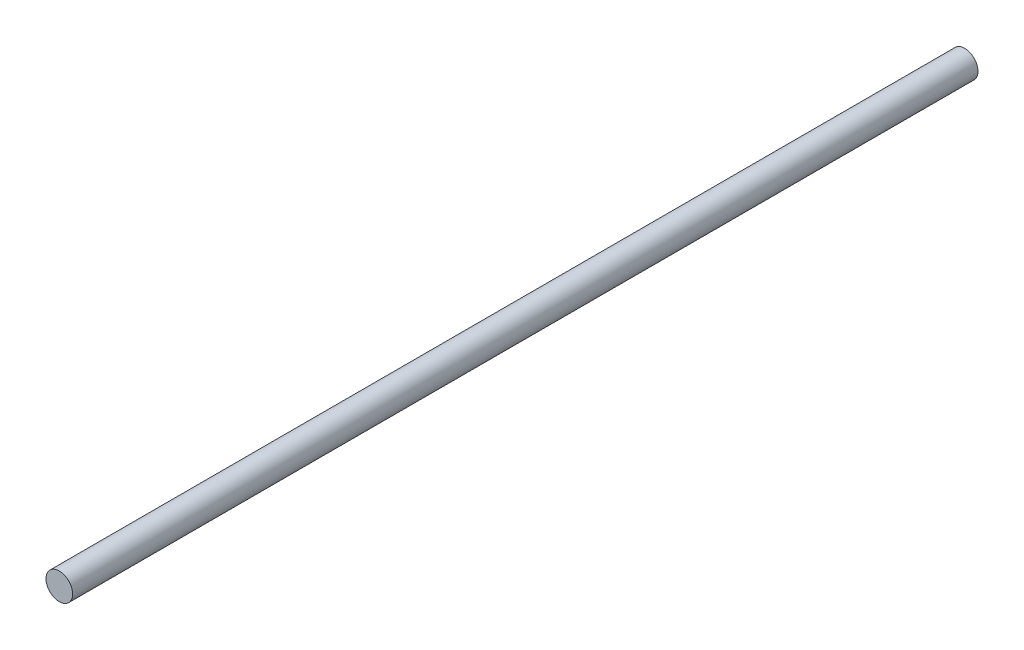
ISO-10303-21;
HEADER;
FILE_DESCRIPTION(('STEP AP214'),'2;1');
FILE_NAME('part.step','',(''),(''),'','','');
FILE_SCHEMA(('AUTOMOTIVE_DESIGN { 1 0 10303 214 1 1 1 1 }'));
ENDSEC;
DATA;
#1=APPLICATION_CONTEXT('core data for automotive mechanical design processes');
#2=APPLICATION_PROTOCOL_DEFINITION('international standard','automotive_design',2000,#1);
#3=PRODUCT_CONTEXT('',#1,'mechanical');
#4=PRODUCT('Part','Part','',(#3));
#5=PRODUCT_RELATED_PRODUCT_CATEGORY('part','',(#4));
#6=PRODUCT_DEFINITION_FORMATION('','',#4);
#7=PRODUCT_DEFINITION_CONTEXT('part definition',#1,'design');
#8=PRODUCT_DEFINITION('design','',#6,#7);
#9=PRODUCT_DEFINITION_SHAPE('','',#8);
#10=(LENGTH_UNIT() NAMED_UNIT(*) SI_UNIT(.MILLI.,.METRE.));
#11=(NAMED_UNIT(*) PLANE_ANGLE_UNIT() SI_UNIT($,.RADIAN.));
#12=(NAMED_UNIT(*) SI_UNIT($,.STERADIAN.) SOLID_ANGLE_UNIT());
#13=UNCERTAINTY_MEASURE_WITH_UNIT(LENGTH_MEASURE(1.E-05),#10,'distance_accuracy_value','');
#14=(GEOMETRIC_REPRESENTATION_CONTEXT(3) GLOBAL_UNCERTAINTY_ASSIGNED_CONTEXT((#13)) GLOBAL_UNIT_ASSIGNED_CONTEXT((#10,
#11,#12)) REPRESENTATION_CONTEXT('',''));
#15=CARTESIAN_POINT('',(0.,0.,0.));
#16=DIRECTION('',(0.,0.,1.));
#17=DIRECTION('',(1.,0.,0.));
#18=AXIS2_PLACEMENT_3D('',#15,#16,#17);
#19=CARTESIAN_POINT('',(0.,0.,170.));
#20=DIRECTION('',(0.,0.,-1.));
#21=DIRECTION('',(-1.,0.,0.));
#22=AXIS2_PLACEMENT_3D('',#19,#20,#21);
#23=CYLINDRICAL_SURFACE('',#22,2.5);
#24=CARTESIAN_POINT('',(0.,0.,170.));
#25=DIRECTION('',(0.,0.,1.));
#26=DIRECTION('',(1.,0.,0.));
#27=AXIS2_PLACEMENT_3D('',#24,#25,#26);
#28=CIRCLE('',#27,2.5);
#29=CARTESIAN_POINT('',(2.5,0.,170.));
#30=VERTEX_POINT('',#29);
#31=EDGE_CURVE('E10',#30,#30,#28,.T.);
#32=ORIENTED_EDGE('',*,*,#31,.F.);
#33=EDGE_LOOP('',(#32));
#34=FACE_BOUND('',#33,.T.);
#35=CARTESIAN_POINT('',(0.,0.,0.));
#36=DIRECTION('',(0.,0.,1.));
#37=DIRECTION('',(1.,0.,0.));
#38=AXIS2_PLACEMENT_3D('',#35,#36,#37);
#39=CIRCLE('',#38,2.5);
#40=CARTESIAN_POINT('',(2.5,0.,0.));
#41=VERTEX_POINT('',#40);
#42=EDGE_CURVE('E44',#41,#41,#39,.T.);
#43=ORIENTED_EDGE('',*,*,#42,.T.);
#44=EDGE_LOOP('',(#43));
#45=FACE_BOUND('',#44,.T.);
#46=ADVANCED_FACE('F41',(#34,#45),#23,.T.);
#47=CARTESIAN_POINT('',(0.,0.,170.));
#48=DIRECTION('',(0.,0.,1.));
#49=DIRECTION('',(1.,0.,0.));
#50=AXIS2_PLACEMENT_3D('',#47,#48,#49);
#51=PLANE('',#50);
#52=ORIENTED_EDGE('',*,*,#31,.T.);
#53=EDGE_LOOP('',(#52));
#54=FACE_BOUND('',#53,.T.);
#55=ADVANCED_FACE('F58',(#54),#51,.T.);
#56=CARTESIAN_POINT('',(0.,0.,0.));
#57=DIRECTION('',(0.,0.,1.));
#58=DIRECTION('',(1.,0.,0.));
#59=AXIS2_PLACEMENT_3D('',#56,#57,#58);
#60=PLANE('',#59);
#61=ORIENTED_EDGE('',*,*,#42,.F.);
#62=EDGE_LOOP('',(#61));
#63=FACE_BOUND('',#62,.T.);
#64=ADVANCED_FACE('F56',(#63),#60,.F.);
#65=CLOSED_SHELL('',(#46,#55,#64));
#66=MANIFOLD_SOLID_BREP('B2',#65);
#67=ADVANCED_BREP_SHAPE_REPRESENTATION('',(#18,#66),#14);
#68=SHAPE_DEFINITION_REPRESENTATION(#9,#67);
ENDSEC;
END-ISO-10303-21;
